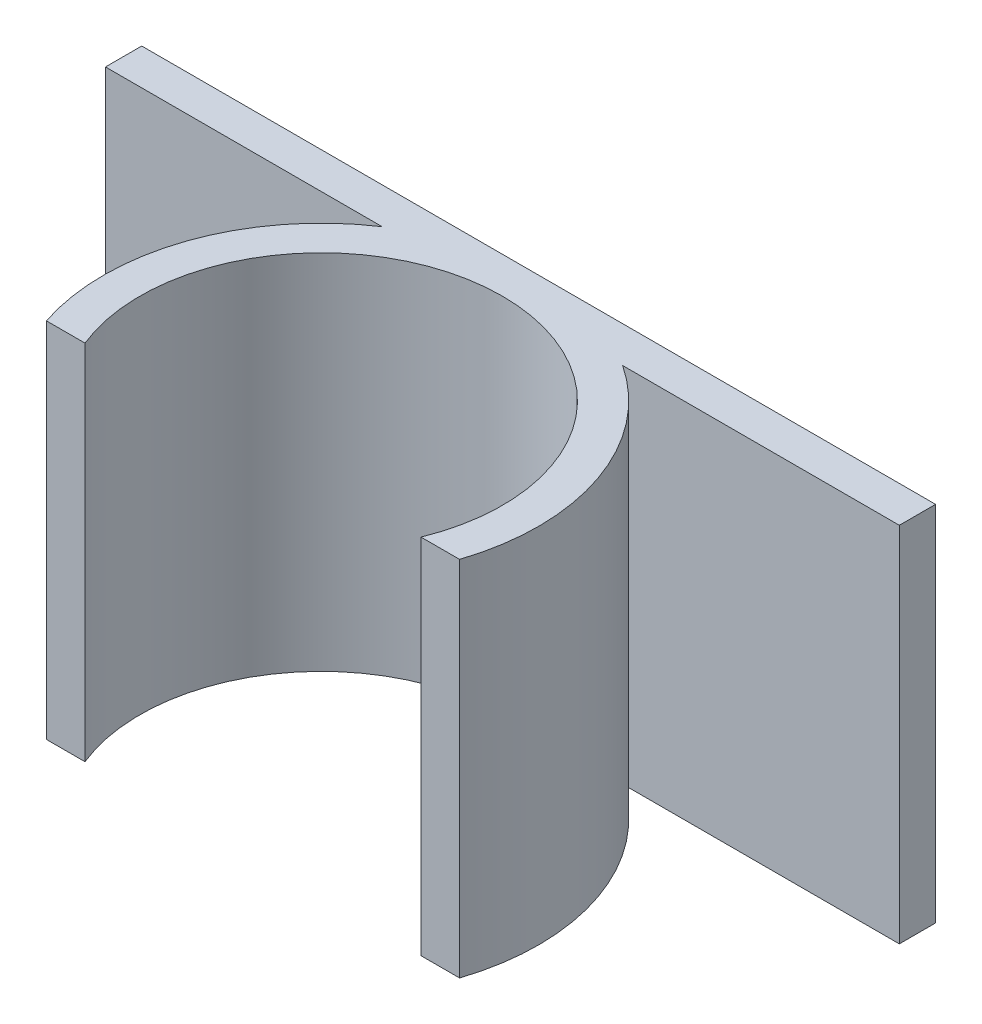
from build123d import *

# Parameters (mm, degrees)
SKETCH_1_R          = 6
SKETCH_1_R_2        = 5
EXTRUDE_1_DEPTH     = 10
EXTRUDE_2_DEPTH     = 10
SKETCH_3_W          = 14.725939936
SKETCH_3_H          = 3.028977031
CUT_EXTRUDE_1_DEPTH = 10
SKETCH_4_W          = 14.115294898
SKETCH_4_H          = 1.091734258
CUT_EXTRUDE_2_DEPTH = 10


with BuildPart() as part:
    # Sketch 1 → Extrude 1 (new body)
    with BuildSketch(Plane(origin=(0, 0, 0), x_dir=(1, 0, 0), z_dir=(0, 1, 0))):
        with Locations(Location((0, 0, 0), (0, 0, 270))):
            Circle(SKETCH_1_R)
        with Locations(Location((0, 0, 0), (0, 0, 270))):
            Circle(SKETCH_1_R_2, mode=Mode.SUBTRACT)
    extrude(amount=EXTRUDE_1_DEPTH)

    # Sketch 2 → Extrude 2 (add)
    with BuildSketch(Plane.XZ):
        with BuildLine():
            Line((-10.948328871, -6), (0, -6))
            ThreePointArc((0, -6), (-1.732050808, -5.744562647), (-3.31662479, -5))
            Line((-3.31662479, -5), (-10.948328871, -5))
            Line((-10.948328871, -5), (-10.948328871, -6))
        make_face()
        with BuildLine():
            ThreePointArc((3.31662479, -5), (1.732050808, -5.744562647), (0, -6))
            Line((0, -6), (10.948328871, -6))
            Line((10.948328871, -6), (10.948328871, -5))
            Line((10.948328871, -5), (3.31662479, -5))
        make_face()
    extrude(amount=-EXTRUDE_2_DEPTH)

    # Sketch 3 → Cut-Extrude 1 (cut)
    with BuildSketch(Plane(origin=(0, 10, 0), x_dir=(1, 0, 0), z_dir=(0, 1, 0))):
        with Locations((0.223120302, -4.485511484)):
            Rectangle(SKETCH_3_W, SKETCH_3_H)
    extrude(amount=-CUT_EXTRUDE_1_DEPTH, mode=Mode.SUBTRACT)

    # Sketch 4 → Cut-Extrude 2 (cut)
    with BuildSketch(Plane.XZ):
        with Locations((-0.105688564, 2.42515584)):
            Rectangle(SKETCH_4_W, SKETCH_4_H)
    extrude(amount=-CUT_EXTRUDE_2_DEPTH, mode=Mode.SUBTRACT)


solid = part.part
